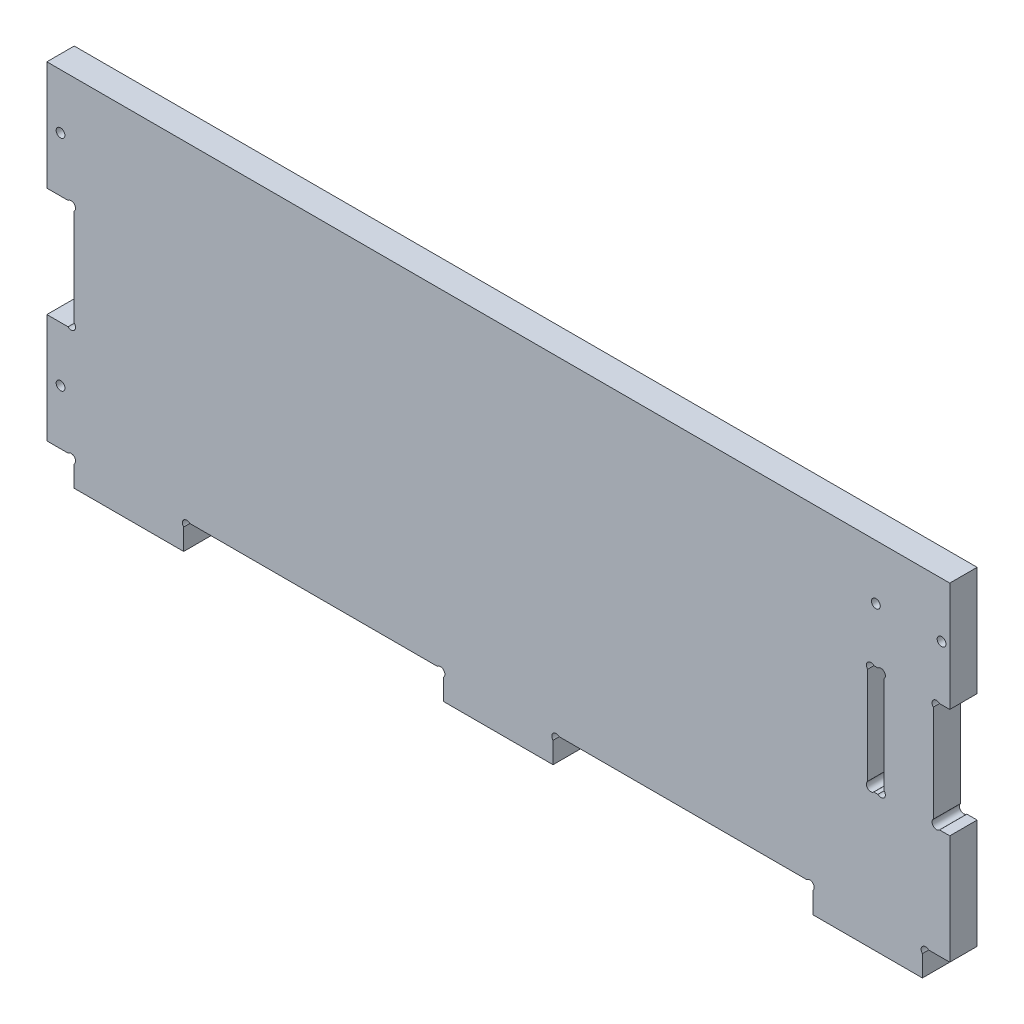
from build123d import *

# Parameters (mm, degrees)
ESQUISSE1_R      = 1.6
EXTRUSION1_DEPTH = 10


with BuildPart() as part:
    # Esquisse1 → Extrusion1 (new body)
    with BuildSketch(Plane.XY):
        with BuildLine():
            Line((326.2627417, 50), (330, 50))
            Line((330, 50), (330, 10))
            Line((330, 10), (322.2627417, 10))
            ThreePointArc((322.2627417, 10), (320, 10), (320, 7.7372583))
            Line((320, 7.7372583), (320, 0))
            Line((320, 0), (280, 0))
            Line((280, 0), (280, 7.7372583))
            ThreePointArc((280, 7.7372583), (280, 10), (277.7372583, 10))
            Line((277.7372583, 10), (187.2627417, 10))
            ThreePointArc((187.2627417, 10), (185, 10), (185, 7.7372583))
            Line((185, 7.7372583), (185, 0))
            Line((185, 0), (145, 0))
            Line((145, 0), (145, 7.7372583))
            ThreePointArc((145, 7.7372583), (145, 10), (142.7372583, 10))
            Line((142.7372583, 10), (52.2627417, 10))
            ThreePointArc((52.2627417, 10), (50, 10), (50, 7.7372583))
            Line((50, 7.7372583), (50, 0))
            Line((50, 0), (10, 0))
            Line((10, 0), (10, 7.7372583))
            ThreePointArc((10, 7.7372583), (10, 10), (7.7372583, 10))
            Line((7.7372583, 10), (0, 10))
            Line((0, 10), (0, 50))
            Line((0, 50), (7.7372583, 50))
            ThreePointArc((7.7372583, 50), (10, 50), (10, 52.2627417))
            Line((10, 52.2627417), (10, 87.7372583))
            ThreePointArc((10, 87.7372583), (10, 90), (7.7372583, 90))
            Line((7.7372583, 90), (0, 90))
            Line((0, 90), (0, 130))
            Line((0, 130), (330, 130))
            Line((330, 130), (330, 90))
            Line((330, 90), (326.2627417, 90))
            ThreePointArc((326.2627417, 90), (324, 90), (324, 87.7372583))
            Line((324, 87.7372583), (324, 52.2627417))
            ThreePointArc((324, 52.2627417), (324, 50), (326.2627417, 50))
        make_face()
        with Locations((5, 30)):
            Circle(ESQUISSE1_R, mode=Mode.SUBTRACT)
        with Locations(Location((5, 110, 0), (0, 0, 180))):
            Circle(ESQUISSE1_R, mode=Mode.SUBTRACT)
        with Locations(Location((327, 110, 0), (0, 0, 180))):
            Circle(ESQUISSE1_R, mode=Mode.SUBTRACT)
        with Locations((303, 110)):
            Circle(ESQUISSE1_R, mode=Mode.SUBTRACT)
        with BuildLine():
            Line((302.2627417, 50), (303.7372583, 50))
            ThreePointArc((303.7372583, 50), (306, 50), (306, 52.2627417))
            Line((306, 52.2627417), (306, 87.7372583))
            ThreePointArc((306, 87.7372583), (306, 90), (303.7372583, 90))
            Line((303.7372583, 90), (302.2627417, 90))
            ThreePointArc((302.2627417, 90), (300, 90), (300, 87.7372583))
            Line((300, 87.7372583), (300, 52.2627417))
            ThreePointArc((300, 52.2627417), (300, 50), (302.2627417, 50))
        make_face(mode=Mode.SUBTRACT)
    extrude(amount=EXTRUSION1_DEPTH)


solid = part.part
